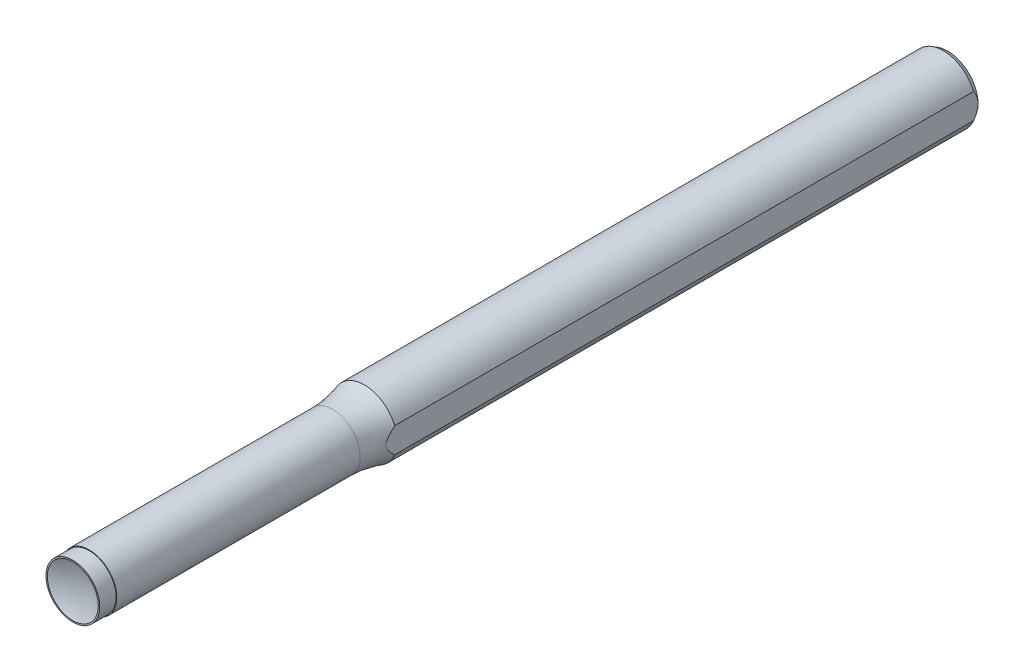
from build123d import *

# Parameters (mm, degrees)
SKETCH1_R           = 4.765
BOSS_EXTRUDE1_DEPTH = 127
SKETCH2_OUTSIDE_W   = 37.072
SKETCH2_OUTSIDE_H   = 37.072
SKETCH2_OUTSIDE_R   = 4
CUT_EXTRUDE1_DEPTH  = 42.333333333
SKETCH3_OUTSIDE_W   = 37.072
SKETCH3_OUTSIDE_H   = 37.072
SKETCH3_OUTSIDE_R   = 3.9
CUT_EXTRUDE2_DEPTH  = 2.3825
CHAMFER1_SIZE       = 0.635333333
CHAMFER1_SIZE2      = 0.366809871
SKETCH7_W           = 3.666687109
SKETCH7_H           = 3.66668711
CUT_EXTRUDE3_DEPTH  = 128.178655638


with BuildPart() as part:
    # Sketch1 → Boss-Extrude1 (new body)
    with BuildSketch(Plane.XY):
        Circle(SKETCH1_R)
    extrude(amount=-BOSS_EXTRUDE1_DEPTH)

    # Sketch2 outside → Cut-Extrude1 (cut)
    with BuildSketch(Plane.XY):
        Rectangle(SKETCH2_OUTSIDE_W, SKETCH2_OUTSIDE_H)
        Circle(SKETCH2_OUTSIDE_R, mode=Mode.SUBTRACT)
    extrude(amount=-CUT_EXTRUDE1_DEPTH, mode=Mode.SUBTRACT)

    # Sketch3 outside → Cut-Extrude2 (cut)
    with BuildSketch(Plane.XY):
        Rectangle(SKETCH3_OUTSIDE_W, SKETCH3_OUTSIDE_H)
        Circle(SKETCH3_OUTSIDE_R, mode=Mode.SUBTRACT)
    extrude(amount=-CUT_EXTRUDE2_DEPTH, mode=Mode.SUBTRACT)

    # Sketch4 → Cut-Revolve1 (revolve, cut)
    with BuildSketch(Plane(origin=(0, 0, 0), x_dir=(0, 0, -1), z_dir=(1, 0, 0)), mode=Mode.PRIVATE) as cut_revolve1_sk:
        with BuildLine():
            Line((0, 0), (0, 3.7))
            ThreePointArc((0, 3.7), (0.558815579, 1.887384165), (0.74758006, 0))
            Line((0.74758006, 0), (0, 0))
        make_face()
    revolve(cut_revolve1_sk.sketch.rotate(Axis((0, 0, 0), (0, 0, -1)), 180), axis=Axis((0, 0, 0), (0, 0, -1)), mode=Mode.SUBTRACT)

    # Chamfer1
    chamfer1_edges = [part.edges().sort_by_distance(p)[0] for p in [
        (-4.765, 0, -127),
    ]]
    chamfer1_side = [part.faces().sort_by_distance(p)[0] for p in [
        (-4.765, 0, -84.666666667),
    ]]
    chamfer(chamfer1_edges, length=CHAMFER1_SIZE, length2=CHAMFER1_SIZE2, reference=chamfer1_side[0])

    # Sketch5 → Revolve1 (revolve)
    with BuildSketch(Plane(origin=(0, 0, 0), x_dir=(0, 0, -1), z_dir=(1, 0, 0)), mode=Mode.PRIVATE) as revolve1_sk:
        with BuildLine():
            Line((42.333333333, 0), (37.719644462, 0))
            Line((37.719644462, 0), (37.719644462, 4))
            ThreePointArc((37.719644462, 4), (40.05798522, 4.192546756), (42.333333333, 4.765))
            Line((42.333333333, 4.765), (42.333333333, 0))
        make_face()
    revolve(revolve1_sk.sketch.rotate(Axis((0, 0, -42.333333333), (0, 0, 1)), 270), axis=Axis((0, 0, -42.333333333), (0, 0, 1)))

    # Sketch7 → Cut-Extrude3 (cut, through all)
    with BuildSketch(Plane(origin=(0, 0, -127), x_dir=(-1, 0, 0), z_dir=(0, 0, -1))):
        with Locations((-6.231533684, 0)):
            Rectangle(SKETCH7_W, SKETCH7_H)
    extrude(amount=-CUT_EXTRUDE3_DEPTH, mode=Mode.SUBTRACT)


solid = part.part
